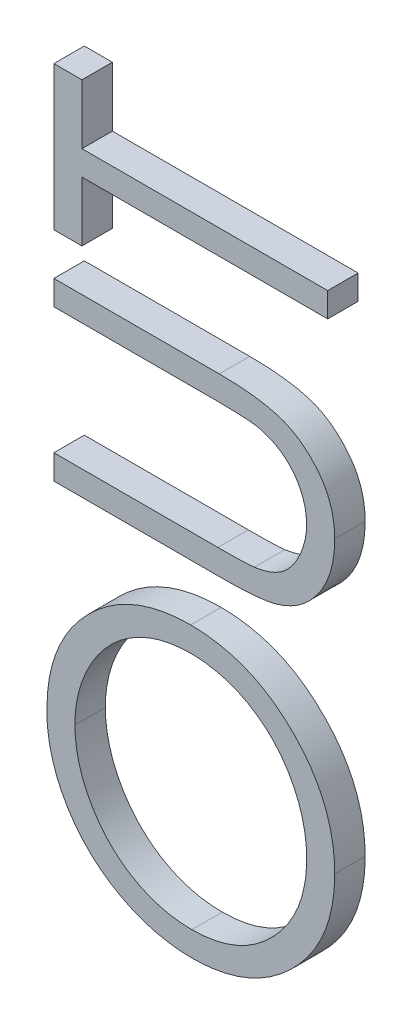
from build123d import *

# Parameters (mm, degrees)
ESTRUSIONE_ESTRUSIONE1_DEPTH   = 10
ESTRUSIONE_ESTRUSIONE1_2_DEPTH = 10
ESTRUSIONE_ESTRUSIONE1_3_DEPTH = 10


with BuildPart() as part:
    # Schizzo2 → Estrusione-Estrusione1 (new body)
    with BuildSketch(Plane.XY):
        with BuildLine():
            add(Edge.make_bspline(
                [(102.692307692, 53.653846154), (102.733806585, 55.320522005), (102.815313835, 58.594010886), (103.459836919, 63.400564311), (104.520654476, 68.003054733), (106.018755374, 72.404128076), (107.960854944, 76.587045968), (110.319949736, 80.563622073), (113.110376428, 84.32193899), (116.291160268, 87.836126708), (119.774637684, 91.04188004), (123.503766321, 93.854945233), (127.431661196, 96.228031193), (131.558527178, 98.170660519), (135.874729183, 99.69575329), (140.404457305, 100.74788327), (145.118043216, 101.420027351), (148.333021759, 101.498601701), (149.963942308, 101.538461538)],
                knots=[0, 0, 0, 0, 1.065064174, 2.09187391, 3.093564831, 4.079973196, 5.057907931, 6.036227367, 7.030399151, 8.044883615, 9.061699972, 10.052012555, 11.025713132, 11.989727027, 12.962874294, 13.945865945, 14.957962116, 16, 16, 16, 16], degree=3))
            add(Edge.make_bspline(
                [(149.963942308, 101.538461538), (151.582839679, 101.498588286), (154.773873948, 101.419993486), (159.457682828, 100.747337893), (163.959573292, 99.691058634), (168.269511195, 98.189543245), (172.387995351, 96.245423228), (176.318863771, 93.86884373), (180.057952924, 91.061117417), (183.565428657, 87.868977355), (186.773956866, 84.378863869), (189.60400372, 80.664067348), (191.978122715, 76.736277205), (193.94243974, 72.636196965), (195.435749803, 68.331631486), (196.522928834, 63.853905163), (197.188400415, 59.178621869), (197.267492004, 55.993777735), (197.307692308, 54.375)],
                knots=[0, 0, 0, 0, 1.043748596, 2.057349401, 3.045489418, 4.02252776, 4.995289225, 5.97782527, 6.980224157, 8.006516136, 9.032559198, 10.034193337, 11.013412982, 11.987833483, 12.961212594, 13.946489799, 14.956251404, 16, 16, 16, 16], degree=3))
            add(Edge.make_bspline(
                [(197.307692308, 54.375), (197.267850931, 52.744088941), (197.189312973, 49.529129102), (196.51607685, 44.809605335), (195.463300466, 40.276749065), (193.958772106, 35.943522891), (192.014329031, 31.807510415), (189.643359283, 27.860622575), (186.830032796, 24.118701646), (183.637178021, 20.612771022), (180.161338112, 17.404934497), (176.437028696, 14.608264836), (172.537316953, 12.236761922), (168.451380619, 10.298847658), (164.198972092, 8.764618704), (159.751725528, 7.71792338), (155.134995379, 7.040713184), (151.991606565, 6.962674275), (150.396634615, 6.923076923)],
                knots=[0, 0, 0, 0, 1.053102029, 2.075944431, 3.073151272, 4.055350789, 5.033113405, 6.020478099, 7.024410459, 8.052272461, 9.079885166, 10.07527673, 11.055994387, 12.023226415, 12.992069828, 13.970394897, 14.97016774, 16, 16, 16, 16], degree=3))
            add(Edge.make_bspline(
                [(150.396634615, 6.923076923), (149.326080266, 6.936824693), (147.19847709, 6.964146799), (144.039050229, 7.293076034), (140.930433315, 7.770376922), (137.881466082, 8.454426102), (134.899612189, 9.349068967), (131.964306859, 10.404692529), (129.10529682, 11.694002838), (126.309038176, 13.151505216), (123.619120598, 14.778237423), (121.076502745, 16.575042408), (118.659848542, 18.478809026), (116.431782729, 20.56586772), (114.327488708, 22.767433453), (112.379304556, 25.119220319), (110.56966296, 27.606878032), (108.938854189, 30.241110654), (107.463905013, 32.957009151), (106.198200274, 35.756697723), (105.111872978, 38.602152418), (104.231394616, 41.506700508), (103.536285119, 44.462628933), (103.062953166, 47.476389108), (102.733184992, 50.545580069), (102.705992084, 52.613299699), (102.692307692, 53.653846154)],
                knots=[0, 0, 0, 0, 1.037015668, 2.060948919, 3.074880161, 4.083647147, 5.086022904, 6.090072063, 7.104153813, 8.122640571, 9.144368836, 10.147691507, 11.138137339, 12.123020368, 13.103399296, 14.087645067, 15.080126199, 16.082011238, 17.087798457, 18.072939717, 19.057185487, 20.037253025, 21.01195951, 21.997135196, 22.992090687, 24, 24, 24, 24], degree=3))
        make_face()
        with BuildLine():
            add(Edge.make_bspline(
                [(111.923076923, 54.050480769), (111.933452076, 53.19637927), (111.954103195, 51.496341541), (112.227615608, 48.969186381), (112.614648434, 46.474500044), (113.176755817, 44.017110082), (113.903817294, 41.591862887), (114.780710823, 39.197681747), (115.840568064, 36.842775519), (117.032506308, 34.530086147), (118.386357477, 32.313029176), (119.824015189, 30.186265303), (121.398896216, 28.205113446), (123.07694135, 26.342358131), (124.872713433, 24.602631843), (126.774419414, 22.98670196), (128.790284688, 21.495893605), (130.912013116, 20.148148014), (133.127758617, 18.948759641), (135.395165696, 17.874896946), (137.740881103, 16.984705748), (140.150266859, 16.279541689), (142.612705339, 15.681018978), (145.141612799, 15.305581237), (147.728271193, 15.029373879), (149.476385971, 15.00986668), (150.360576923, 15)],
                knots=[0, 0, 0, 0, 1.008406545, 2.007172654, 2.999155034, 3.989332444, 4.982025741, 5.988181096, 6.998684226, 8.030553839, 9.059268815, 10.065399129, 11.060956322, 12.046057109, 13.024974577, 14.012068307, 14.991706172, 15.984221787, 16.978487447, 17.966117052, 18.945677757, 19.938371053, 20.93015022, 21.936155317, 22.956113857, 24, 24, 24, 24], degree=3))
            add(Edge.make_bspline(
                [(150.360576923, 15), (151.660718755, 15.032857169), (154.21849995, 15.097497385), (157.967245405, 15.661050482), (161.573456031, 16.536022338), (165.015637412, 17.804566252), (168.309139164, 19.422844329), (171.441144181, 21.396815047), (174.41072855, 23.744555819), (177.195786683, 26.409814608), (179.736807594, 29.324204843), (181.970378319, 32.417375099), (183.85021374, 35.664853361), (185.421713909, 39.047922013), (186.605616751, 42.595465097), (187.44973893, 46.284737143), (187.996838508, 50.115819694), (188.049974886, 52.726480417), (188.076923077, 54.050480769)],
                knots=[0, 0, 0, 0, 1.032022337, 2.030307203, 3.003823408, 3.974715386, 4.937372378, 5.913284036, 6.909147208, 7.938749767, 8.970518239, 9.975863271, 10.963918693, 11.946286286, 12.933361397, 13.927862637, 14.949112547, 16, 16, 16, 16], degree=3))
            add(Edge.make_bspline(
                [(188.076923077, 54.050480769), (188.064705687, 54.940442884), (188.040474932, 56.705505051), (187.79607868, 59.330767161), (187.404944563, 61.90897664), (186.8390103, 64.435369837), (186.140087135, 66.913256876), (185.273144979, 69.335161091), (184.233889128, 71.700278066), (183.075672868, 74.020237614), (181.759970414, 76.24309359), (180.34169365, 78.356956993), (178.794600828, 80.334695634), (177.139092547, 82.19657697), (175.348840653, 83.92411072), (173.45869204, 85.535439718), (171.438548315, 87.00047158), (169.325509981, 88.343648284), (167.125918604, 89.557671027), (164.852277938, 90.600471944), (162.516782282, 91.491045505), (160.117715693, 92.208948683), (157.660474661, 92.771787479), (155.141542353, 93.159537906), (152.566019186, 93.430788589), (150.82403394, 93.451232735), (149.945913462, 93.461538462)],
                knots=[0, 0, 0, 0, 1.047334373, 2.07717862, 3.100662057, 4.115010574, 5.122652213, 6.129548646, 7.140165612, 8.16200981, 9.179904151, 10.178566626, 11.156366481, 12.133321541, 13.108841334, 14.082538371, 15.054589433, 16.043660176, 17.028268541, 18.009491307, 18.985652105, 19.968123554, 20.954864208, 21.950389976, 22.966808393, 24, 24, 24, 24], degree=3))
            add(Edge.make_bspline(
                [(149.945913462, 93.461538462), (149.073800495, 93.451224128), (147.343803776, 93.430763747), (144.786239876, 93.159671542), (142.285443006, 92.771362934), (139.85123094, 92.211750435), (137.482983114, 91.490460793), (135.18292403, 90.6010722), (132.942484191, 89.552307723), (130.767204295, 88.348666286), (128.679846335, 86.995693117), (126.684383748, 85.517250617), (124.818122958, 83.887927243), (123.035621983, 82.153848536), (121.372534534, 80.273323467), (119.835286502, 78.246023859), (118.35461462, 76.122426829), (117.044203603, 73.854508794), (115.827982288, 71.522331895), (114.790358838, 69.127055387), (113.899187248, 66.702887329), (113.174585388, 64.240135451), (112.616801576, 61.739963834), (112.227269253, 59.203826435), (111.954197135, 56.640575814), (111.933483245, 54.916585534), (111.923076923, 54.050480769)],
                knots=[0, 0, 0, 0, 1.029877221, 2.042951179, 3.035109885, 4.018542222, 4.991021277, 5.957494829, 6.929429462, 7.911425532, 8.892163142, 9.866273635, 10.842761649, 11.81676864, 12.802607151, 13.805177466, 14.821356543, 15.858816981, 16.897175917, 17.927346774, 18.940346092, 19.946830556, 20.957962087, 21.964146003, 22.97721996, 24, 24, 24, 24], degree=3))
        make_face(mode=Mode.SUBTRACT)
    extrude(amount=ESTRUSIONE_ESTRUSIONE1_DEPTH)


with BuildPart() as body_2:
    # Schizzo2 → Estrusione-Estrusione1 2 (new body)
    with BuildSketch(Plane.XY):
        with BuildLine():
            Line((105, 120), (105, 128.076923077))
            Line((105, 128.076923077), (158.924278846, 128.076923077))
            add(Edge.make_bspline(
                [(158.924278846, 128.076923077), (159.687497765, 128.075721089), (161.13583719, 128.07344011), (163.197307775, 128.088676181), (165.03002815, 128.131345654), (166.641062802, 128.1582469), (168.023019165, 128.21809262), (169.183384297, 128.26689954), (170.116663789, 128.329656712), (170.661316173, 128.405079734), (170.895432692, 128.4375)],
                knots=[0, 0, 0, 0, 1.528628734, 2.90083645, 4.128790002, 5.200304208, 6.127813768, 6.898992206, 7.526736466, 8, 8, 8, 8], degree=3))
            add(Edge.make_bspline(
                [(170.895432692, 128.4375), (171.746539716, 128.569118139), (173.389563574, 128.823201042), (175.72757508, 129.498251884), (177.838587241, 130.3982034), (179.770217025, 131.514647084), (181.510188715, 132.92527851), (183.071856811, 134.676620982), (184.491016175, 136.737275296), (185.728319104, 139.077718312), (186.756003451, 141.571464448), (187.524975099, 144.129112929), (187.995585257, 146.7013012), (188.049934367, 148.423590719), (188.076923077, 149.278846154)],
                knots=[0, 0, 0, 0, 1.042777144, 2.01303441, 2.939567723, 3.817555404, 4.708046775, 5.641195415, 6.651191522, 7.732783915, 8.843021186, 9.914367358, 10.964315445, 12, 12, 12, 12], degree=3))
            add(Edge.make_bspline(
                [(188.076923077, 149.278846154), (188.049462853, 150.013149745), (187.994701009, 151.477515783), (187.651413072, 153.652148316), (187.044922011, 155.776808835), (186.218770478, 157.834806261), (185.202825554, 159.792694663), (183.985740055, 161.600276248), (182.568071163, 163.220162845), (180.996902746, 164.69839964), (179.226377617, 165.978075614), (177.299209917, 167.10950927), (175.164012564, 168.008075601), (173.664350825, 168.463017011), (172.896634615, 168.695913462)],
                knots=[0, 0, 0, 0, 0.994718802, 1.98369237, 2.973235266, 3.981451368, 4.982709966, 5.955777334, 6.925228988, 7.892833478, 8.871333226, 9.877970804, 10.913677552, 12, 12, 12, 12], degree=3))
            add(Edge.make_bspline(
                [(172.896634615, 168.695913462), (172.579099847, 168.773059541), (171.871504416, 168.944972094), (170.675242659, 169.105610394), (169.263801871, 169.272921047), (167.62704097, 169.38900999), (165.770444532, 169.50218423), (163.684340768, 169.569891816), (161.376304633, 169.601186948), (159.765634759, 169.610513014), (158.924278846, 169.615384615)],
                knots=[0, 0, 0, 0, 0.558680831, 1.244966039, 2.062412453, 2.990489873, 4.051219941, 5.244515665, 6.560634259, 8, 8, 8, 8], degree=3))
            Line((158.924278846, 169.615384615), (105, 169.615384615))
            Line((105, 169.615384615), (105, 177.692307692))
            Line((105, 177.692307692), (159.356971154, 177.692307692))
            add(Edge.make_bspline(
                [(159.356971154, 177.692307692), (160.336643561, 177.685772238), (162.248533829, 177.673017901), (165.050142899, 177.562444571), (167.707781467, 177.386076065), (170.221861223, 177.137110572), (172.58319883, 176.806478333), (174.80734787, 176.442196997), (176.882045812, 175.970178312), (178.83122932, 175.422923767), (180.696045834, 174.806242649), (182.462382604, 173.993496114), (184.182117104, 173.081778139), (185.835992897, 172.009189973), (187.41350219, 170.775223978), (188.955480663, 169.427154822), (190.415973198, 167.917466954), (191.812992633, 166.290751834), (193.112221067, 164.557946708), (194.242844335, 162.707862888), (195.163478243, 160.750714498), (195.980558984, 158.732845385), (196.561319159, 156.605875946), (197.002897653, 154.396300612), (197.251695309, 152.091013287), (197.288868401, 150.523389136), (197.307692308, 149.729567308)],
                knots=[0, 0, 0, 0, 1.316707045, 2.569633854, 3.76780728, 4.896239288, 5.964314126, 6.972204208, 7.924543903, 8.822147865, 9.693191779, 10.560896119, 11.431827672, 12.307838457, 13.206132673, 14.12176355, 15.058527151, 16.026630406, 17.00238624, 17.966538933, 18.934743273, 19.906713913, 20.888635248, 21.892958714, 22.933025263, 24, 24, 24, 24], degree=3))
            add(Edge.make_bspline(
                [(197.307692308, 149.729567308), (197.287526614, 148.86378406), (197.247961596, 147.165120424), (197.020892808, 144.662231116), (196.594284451, 142.262396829), (196.047565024, 139.942195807), (195.305849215, 137.724043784), (194.394478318, 135.608594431), (193.354009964, 133.571557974), (192.12453256, 131.658828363), (190.78387021, 129.854714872), (189.31129962, 128.215188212), (187.762903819, 126.698628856), (186.080377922, 125.371883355), (184.298164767, 124.184769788), (182.407881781, 123.163446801), (180.41206298, 122.286166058), (179.024684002, 121.83343704), (178.323317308, 121.604567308)],
                knots=[0, 0, 0, 0, 1.138939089, 2.234594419, 3.301501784, 4.342532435, 5.367382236, 6.373123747, 7.370098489, 8.372230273, 9.360297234, 10.323289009, 11.268038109, 12.20748145, 13.137029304, 14.081414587, 15.030090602, 16, 16, 16, 16], degree=3))
            add(Edge.make_bspline(
                [(178.323317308, 121.604567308), (177.844193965, 121.471440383), (176.804964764, 121.182685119), (175.085026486, 120.87346318), (173.10464289, 120.613515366), (170.863678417, 120.369086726), (168.360396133, 120.224856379), (165.595881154, 120.098407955), (162.56679071, 119.999109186), (160.456817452, 119.999694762), (159.356971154, 120)],
                knots=[0, 0, 0, 0, 0.625038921, 1.35572334, 2.194682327, 3.136881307, 4.189498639, 5.346923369, 6.617055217, 8, 8, 8, 8], degree=3))
            Line((159.356971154, 120), (105, 120))
        make_face()
    extrude(amount=ESTRUSIONE_ESTRUSIONE1_2_DEPTH)


with BuildPart() as body_3:
    # Schizzo2 → Estrusione-Estrusione1 3 (new body)
    with BuildSketch(Plane.XY):
        Polygon((114.230769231, 191.538461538), (105, 191.538461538), (105, 238.846153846), (114.230769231, 238.846153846), (114.230769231, 219.230769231), (195, 219.230769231), (195, 211.153846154), (114.230769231, 211.153846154), align=None)
    extrude(amount=ESTRUSIONE_ESTRUSIONE1_3_DEPTH)


solid = Compound([part.part, body_2.part, body_3.part])
